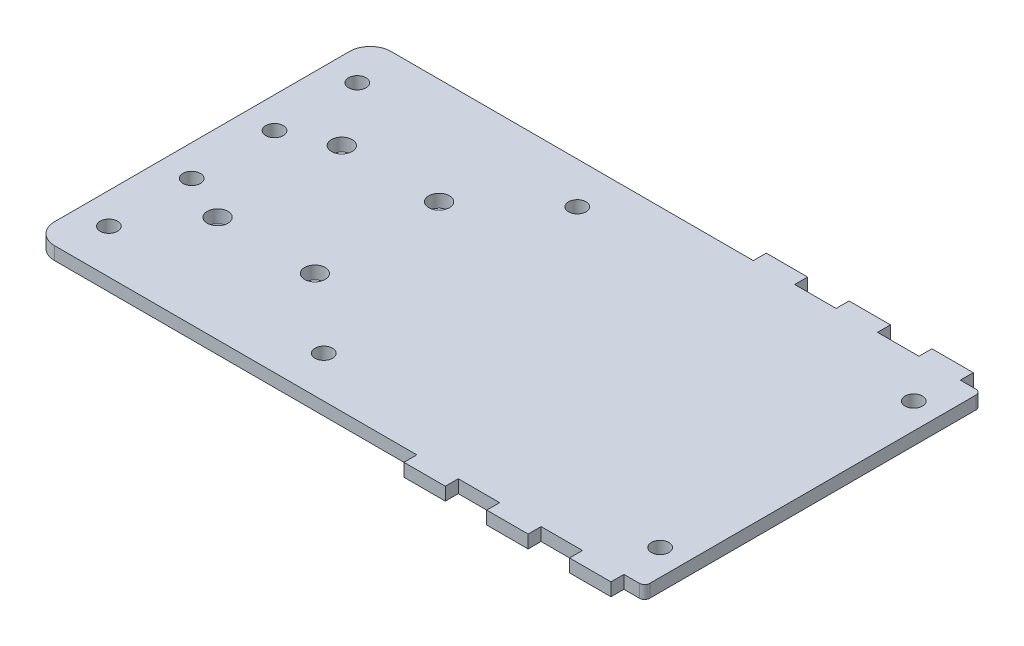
ISO-10303-21;
HEADER;
FILE_DESCRIPTION(('STEP AP214'),'2;1');
FILE_NAME('part.step','',(''),(''),'','','');
FILE_SCHEMA(('AUTOMOTIVE_DESIGN { 1 0 10303 214 1 1 1 1 }'));
ENDSEC;
DATA;
#1=APPLICATION_CONTEXT('core data for automotive mechanical design processes');
#2=APPLICATION_PROTOCOL_DEFINITION('international standard','automotive_design',2000,#1);
#3=PRODUCT_CONTEXT('',#1,'mechanical');
#4=PRODUCT('Part','Part','',(#3));
#5=PRODUCT_RELATED_PRODUCT_CATEGORY('part','',(#4));
#6=PRODUCT_DEFINITION_FORMATION('','',#4);
#7=PRODUCT_DEFINITION_CONTEXT('part definition',#1,'design');
#8=PRODUCT_DEFINITION('design','',#6,#7);
#9=PRODUCT_DEFINITION_SHAPE('','',#8);
#10=(LENGTH_UNIT() NAMED_UNIT(*) SI_UNIT(.MILLI.,.METRE.));
#11=(NAMED_UNIT(*) PLANE_ANGLE_UNIT() SI_UNIT($,.RADIAN.));
#12=(NAMED_UNIT(*) SI_UNIT($,.STERADIAN.) SOLID_ANGLE_UNIT());
#13=UNCERTAINTY_MEASURE_WITH_UNIT(LENGTH_MEASURE(1.E-05),#10,'distance_accuracy_value','');
#14=(GEOMETRIC_REPRESENTATION_CONTEXT(3) GLOBAL_UNCERTAINTY_ASSIGNED_CONTEXT((#13)) GLOBAL_UNIT_ASSIGNED_CONTEXT((#10,
#11,#12)) REPRESENTATION_CONTEXT('',''));
#15=CARTESIAN_POINT('',(0.,0.,0.));
#16=DIRECTION('',(0.,0.,1.));
#17=DIRECTION('',(1.,0.,0.));
#18=AXIS2_PLACEMENT_3D('',#15,#16,#17);
#19=CARTESIAN_POINT('',(0.,3.175,41.275));
#20=DIRECTION('',(0.,0.,1.));
#21=DIRECTION('',(1.,0.,0.));
#22=AXIS2_PLACEMENT_3D('',#19,#20,#21);
#23=PLANE('',#22);
#24=DIRECTION('',(-1.,0.,0.));
#25=VECTOR('',#24,1.);
#26=CARTESIAN_POINT('',(0.,0.,41.275));
#27=LINE('',#26,#25);
#28=CARTESIAN_POINT('',(38.1,0.,41.275));
#29=VERTEX_POINT('',#28);
#30=CARTESIAN_POINT('',(27.94,0.,41.275));
#31=VERTEX_POINT('',#30);
#32=EDGE_CURVE('E493',#29,#31,#27,.T.);
#33=ORIENTED_EDGE('',*,*,#32,.F.);
#34=DIRECTION('',(0.,-1.,0.));
#35=VECTOR('',#34,1.);
#36=CARTESIAN_POINT('',(38.1,3.175,41.275));
#37=LINE('',#36,#35);
#38=CARTESIAN_POINT('',(38.1,3.175,41.275));
#39=VERTEX_POINT('',#38);
#40=EDGE_CURVE('E437',#39,#29,#37,.T.);
#41=ORIENTED_EDGE('',*,*,#40,.F.);
#42=DIRECTION('',(-1.,0.,0.));
#43=VECTOR('',#42,1.);
#44=CARTESIAN_POINT('',(0.,3.175,41.275));
#45=LINE('',#44,#43);
#46=CARTESIAN_POINT('',(27.94,3.175,41.275));
#47=VERTEX_POINT('',#46);
#48=EDGE_CURVE('E442',#39,#47,#45,.T.);
#49=ORIENTED_EDGE('',*,*,#48,.T.);
#50=DIRECTION('',(0.,-1.,0.));
#51=VECTOR('',#50,1.);
#52=CARTESIAN_POINT('',(27.94,3.175,41.275));
#53=LINE('',#52,#51);
#54=EDGE_CURVE('E426',#47,#31,#53,.T.);
#55=ORIENTED_EDGE('',*,*,#54,.T.);
#56=EDGE_LOOP('',(#33,#41,#49,#55));
#57=FACE_BOUND('',#56,.T.);
#58=ADVANCED_FACE('F219',(#57),#23,.T.);
#59=CARTESIAN_POINT('',(38.1,3.175,0.));
#60=DIRECTION('',(1.,0.,0.));
#61=DIRECTION('',(0.,0.,-1.));
#62=AXIS2_PLACEMENT_3D('',#59,#60,#61);
#63=PLANE('',#62);
#64=DIRECTION('',(0.,0.,1.));
#65=VECTOR('',#64,1.);
#66=CARTESIAN_POINT('',(38.1,0.,0.));
#67=LINE('',#66,#65);
#68=CARTESIAN_POINT('',(38.1,0.,44.45));
#69=VERTEX_POINT('',#68);
#70=EDGE_CURVE('E496',#29,#69,#67,.T.);
#71=ORIENTED_EDGE('',*,*,#70,.T.);
#72=DIRECTION('',(0.,-1.,0.));
#73=VECTOR('',#72,1.);
#74=CARTESIAN_POINT('',(38.1,3.175,44.45));
#75=LINE('',#74,#73);
#76=CARTESIAN_POINT('',(38.1,3.175,44.45));
#77=VERTEX_POINT('',#76);
#78=EDGE_CURVE('E547',#77,#69,#75,.T.);
#79=ORIENTED_EDGE('',*,*,#78,.F.);
#80=DIRECTION('',(0.,0.,1.));
#81=VECTOR('',#80,1.);
#82=CARTESIAN_POINT('',(38.1,3.175,0.));
#83=LINE('',#82,#81);
#84=EDGE_CURVE('E449',#39,#77,#83,.T.);
#85=ORIENTED_EDGE('',*,*,#84,.F.);
#86=ORIENTED_EDGE('',*,*,#40,.T.);
#87=EDGE_LOOP('',(#71,#79,#85,#86));
#88=FACE_BOUND('',#87,.T.);
#89=ADVANCED_FACE('F840',(#88),#63,.F.);
#90=CARTESIAN_POINT('',(0.,3.175,44.45));
#91=DIRECTION('',(0.,0.,-1.));
#92=DIRECTION('',(-1.,0.,0.));
#93=AXIS2_PLACEMENT_3D('',#90,#91,#92);
#94=PLANE('',#93);
#95=DIRECTION('',(1.,0.,0.));
#96=VECTOR('',#95,1.);
#97=CARTESIAN_POINT('',(0.,0.,44.45));
#98=LINE('',#97,#96);
#99=CARTESIAN_POINT('',(48.26,0.,44.45));
#100=VERTEX_POINT('',#99);
#101=EDGE_CURVE('E500',#69,#100,#98,.T.);
#102=ORIENTED_EDGE('',*,*,#101,.T.);
#103=DIRECTION('',(0.,-1.,0.));
#104=VECTOR('',#103,1.);
#105=CARTESIAN_POINT('',(48.26,3.175,44.45));
#106=LINE('',#105,#104);
#107=CARTESIAN_POINT('',(48.26,3.175,44.45));
#108=VERTEX_POINT('',#107);
#109=EDGE_CURVE('E545',#108,#100,#106,.T.);
#110=ORIENTED_EDGE('',*,*,#109,.F.);
#111=DIRECTION('',(1.,0.,0.));
#112=VECTOR('',#111,1.);
#113=CARTESIAN_POINT('',(0.,3.175,44.45));
#114=LINE('',#113,#112);
#115=EDGE_CURVE('E453',#77,#108,#114,.T.);
#116=ORIENTED_EDGE('',*,*,#115,.F.);
#117=ORIENTED_EDGE('',*,*,#78,.T.);
#118=EDGE_LOOP('',(#102,#110,#116,#117));
#119=FACE_BOUND('',#118,.T.);
#120=ADVANCED_FACE('F837',(#119),#94,.F.);
#121=CARTESIAN_POINT('',(48.26,3.175,0.));
#122=DIRECTION('',(1.,0.,0.));
#123=DIRECTION('',(0.,0.,-1.));
#124=AXIS2_PLACEMENT_3D('',#121,#122,#123);
#125=PLANE('',#124);
#126=DIRECTION('',(0.,0.,1.));
#127=VECTOR('',#126,1.);
#128=CARTESIAN_POINT('',(48.26,0.,0.));
#129=LINE('',#128,#127);
#130=CARTESIAN_POINT('',(48.26,0.,41.275));
#131=VERTEX_POINT('',#130);
#132=EDGE_CURVE('E503',#131,#100,#129,.T.);
#133=ORIENTED_EDGE('',*,*,#132,.F.);
#134=DIRECTION('',(0.,-1.,0.));
#135=VECTOR('',#134,1.);
#136=CARTESIAN_POINT('',(48.26,3.175,41.275));
#137=LINE('',#136,#135);
#138=CARTESIAN_POINT('',(48.26,3.175,41.275));
#139=VERTEX_POINT('',#138);
#140=EDGE_CURVE('E543',#139,#131,#137,.T.);
#141=ORIENTED_EDGE('',*,*,#140,.F.);
#142=DIRECTION('',(0.,0.,1.));
#143=VECTOR('',#142,1.);
#144=CARTESIAN_POINT('',(48.26,3.175,0.));
#145=LINE('',#144,#143);
#146=EDGE_CURVE('E468',#139,#108,#145,.T.);
#147=ORIENTED_EDGE('',*,*,#146,.T.);
#148=ORIENTED_EDGE('',*,*,#109,.T.);
#149=EDGE_LOOP('',(#133,#141,#147,#148));
#150=FACE_BOUND('',#149,.T.);
#151=ADVANCED_FACE('F833',(#150),#125,.T.);
#152=CARTESIAN_POINT('',(58.42,0.,41.275));
#153=VERTEX_POINT('',#152);
#154=EDGE_CURVE('E506',#153,#131,#27,.T.);
#155=ORIENTED_EDGE('',*,*,#154,.F.);
#156=DIRECTION('',(0.,1.,0.));
#157=VECTOR('',#156,1.);
#158=CARTESIAN_POINT('',(58.42,3.175,41.275));
#159=LINE('',#158,#157);
#160=CARTESIAN_POINT('',(58.42,3.175,41.275));
#161=VERTEX_POINT('',#160);
#162=EDGE_CURVE('E560',#153,#161,#159,.T.);
#163=ORIENTED_EDGE('',*,*,#162,.T.);
#164=EDGE_CURVE('E456',#161,#139,#45,.T.);
#165=ORIENTED_EDGE('',*,*,#164,.T.);
#166=ORIENTED_EDGE('',*,*,#140,.T.);
#167=EDGE_LOOP('',(#155,#163,#165,#166));
#168=FACE_BOUND('',#167,.T.);
#169=ADVANCED_FACE('F836',(#168),#23,.T.);
#170=CARTESIAN_POINT('',(72.39,0.,41.275));
#171=VERTEX_POINT('',#170);
#172=CARTESIAN_POINT('',(68.58,0.,41.275));
#173=VERTEX_POINT('',#172);
#174=EDGE_CURVE('E497',#171,#173,#27,.T.);
#175=ORIENTED_EDGE('',*,*,#174,.F.);
#176=DIRECTION('',(0.,1.,0.));
#177=VECTOR('',#176,1.);
#178=CARTESIAN_POINT('',(72.39,3.175,41.275));
#179=LINE('',#178,#177);
#180=CARTESIAN_POINT('',(72.39,3.175,41.275));
#181=VERTEX_POINT('',#180);
#182=EDGE_CURVE('E645',#171,#181,#179,.T.);
#183=ORIENTED_EDGE('',*,*,#182,.T.);
#184=CARTESIAN_POINT('',(68.58,3.175,41.275));
#185=VERTEX_POINT('',#184);
#186=EDGE_CURVE('E451',#181,#185,#45,.T.);
#187=ORIENTED_EDGE('',*,*,#186,.T.);
#188=DIRECTION('',(0.,1.,0.));
#189=VECTOR('',#188,1.);
#190=CARTESIAN_POINT('',(68.58,3.175,41.275));
#191=LINE('',#190,#189);
#192=EDGE_CURVE('E557',#173,#185,#191,.T.);
#193=ORIENTED_EDGE('',*,*,#192,.F.);
#194=EDGE_LOOP('',(#175,#183,#187,#193));
#195=FACE_BOUND('',#194,.T.);
#196=ADVANCED_FACE('F761',(#195),#23,.T.);
#197=CARTESIAN_POINT('',(0.,3.175,-41.275));
#198=DIRECTION('',(0.,0.,1.));
#199=DIRECTION('',(1.,0.,0.));
#200=AXIS2_PLACEMENT_3D('',#197,#198,#199);
#201=PLANE('',#200);
#202=DIRECTION('',(-1.,0.,0.));
#203=VECTOR('',#202,1.);
#204=CARTESIAN_POINT('',(0.,3.175,-41.275));
#205=LINE('',#204,#203);
#206=CARTESIAN_POINT('',(72.39,3.175,-41.275));
#207=VERTEX_POINT('',#206);
#208=CARTESIAN_POINT('',(68.5799999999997,3.175,-41.275));
#209=VERTEX_POINT('',#208);
#210=EDGE_CURVE('E479',#207,#209,#205,.T.);
#211=ORIENTED_EDGE('',*,*,#210,.F.);
#212=DIRECTION('',(0.,1.,0.));
#213=VECTOR('',#212,1.);
#214=CARTESIAN_POINT('',(72.39,3.175,-41.275));
#215=LINE('',#214,#213);
#216=CARTESIAN_POINT('',(72.39,0.,-41.275));
#217=VERTEX_POINT('',#216);
#218=EDGE_CURVE('E227',#207,#217,#215,.F.);
#219=ORIENTED_EDGE('',*,*,#218,.T.);
#220=DIRECTION('',(-1.,0.,0.));
#221=VECTOR('',#220,1.);
#222=CARTESIAN_POINT('',(0.,0.,-41.275));
#223=LINE('',#222,#221);
#224=CARTESIAN_POINT('',(68.5799999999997,0.,-41.275));
#225=VERTEX_POINT('',#224);
#226=EDGE_CURVE('E507',#217,#225,#223,.T.);
#227=ORIENTED_EDGE('',*,*,#226,.T.);
#228=DIRECTION('',(0.,1.,0.));
#229=VECTOR('',#228,1.);
#230=CARTESIAN_POINT('',(68.5799999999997,3.175,-41.275));
#231=LINE('',#230,#229);
#232=EDGE_CURVE('E553',#225,#209,#231,.T.);
#233=ORIENTED_EDGE('',*,*,#232,.T.);
#234=EDGE_LOOP('',(#211,#219,#227,#233));
#235=FACE_BOUND('',#234,.T.);
#236=ADVANCED_FACE('F827',(#235),#201,.F.);
#237=CARTESIAN_POINT('',(58.4199999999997,3.175,-41.275));
#238=VERTEX_POINT('',#237);
#239=CARTESIAN_POINT('',(48.2599999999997,3.175,-41.275));
#240=VERTEX_POINT('',#239);
#241=EDGE_CURVE('E482',#238,#240,#205,.T.);
#242=ORIENTED_EDGE('',*,*,#241,.F.);
#243=DIRECTION('',(0.,-1.,0.));
#244=VECTOR('',#243,1.);
#245=CARTESIAN_POINT('',(58.4199999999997,3.175,-41.2750000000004));
#246=LINE('',#245,#244);
#247=CARTESIAN_POINT('',(58.4199999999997,0.,-41.275));
#248=VERTEX_POINT('',#247);
#249=EDGE_CURVE('E556',#238,#248,#246,.T.);
#250=ORIENTED_EDGE('',*,*,#249,.T.);
#251=CARTESIAN_POINT('',(48.2599999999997,0.,-41.275));
#252=VERTEX_POINT('',#251);
#253=EDGE_CURVE('E510',#248,#252,#223,.T.);
#254=ORIENTED_EDGE('',*,*,#253,.T.);
#255=DIRECTION('',(0.,1.,0.));
#256=VECTOR('',#255,1.);
#257=CARTESIAN_POINT('',(48.2599999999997,3.175,-41.275));
#258=LINE('',#257,#256);
#259=EDGE_CURVE('E436',#252,#240,#258,.T.);
#260=ORIENTED_EDGE('',*,*,#259,.T.);
#261=EDGE_LOOP('',(#242,#250,#254,#260));
#262=FACE_BOUND('',#261,.T.);
#263=ADVANCED_FACE('F792',(#262),#201,.F.);
#264=CARTESIAN_POINT('',(38.0999999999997,3.175,-41.275));
#265=VERTEX_POINT('',#264);
#266=CARTESIAN_POINT('',(27.9399999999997,3.175,-41.275));
#267=VERTEX_POINT('',#266);
#268=EDGE_CURVE('E455',#265,#267,#205,.T.);
#269=ORIENTED_EDGE('',*,*,#268,.F.);
#270=DIRECTION('',(0.,-1.,0.));
#271=VECTOR('',#270,1.);
#272=CARTESIAN_POINT('',(38.0999999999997,3.175,-41.275));
#273=LINE('',#272,#271);
#274=CARTESIAN_POINT('',(38.0999999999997,0.,-41.275));
#275=VERTEX_POINT('',#274);
#276=EDGE_CURVE('E552',#265,#275,#273,.T.);
#277=ORIENTED_EDGE('',*,*,#276,.T.);
#278=CARTESIAN_POINT('',(27.9399999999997,0.,-41.275));
#279=VERTEX_POINT('',#278);
#280=EDGE_CURVE('E511',#275,#279,#223,.T.);
#281=ORIENTED_EDGE('',*,*,#280,.T.);
#282=DIRECTION('',(0.,-1.,0.));
#283=VECTOR('',#282,1.);
#284=CARTESIAN_POINT('',(27.9399999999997,3.175,-41.275));
#285=LINE('',#284,#283);
#286=EDGE_CURVE('E540',#267,#279,#285,.T.);
#287=ORIENTED_EDGE('',*,*,#286,.F.);
#288=EDGE_LOOP('',(#269,#277,#281,#287));
#289=FACE_BOUND('',#288,.T.);
#290=ADVANCED_FACE('F809',(#289),#201,.F.);
#291=CARTESIAN_POINT('',(27.9399999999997,3.175,0.));
#292=DIRECTION('',(1.,0.,0.));
#293=DIRECTION('',(0.,0.,-1.));
#294=AXIS2_PLACEMENT_3D('',#291,#292,#293);
#295=PLANE('',#294);
#296=DIRECTION('',(0.,0.,1.));
#297=VECTOR('',#296,1.);
#298=CARTESIAN_POINT('',(27.9399999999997,0.,0.));
#299=LINE('',#298,#297);
#300=CARTESIAN_POINT('',(27.9399999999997,0.,-44.4499999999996));
#301=VERTEX_POINT('',#300);
#302=EDGE_CURVE('E509',#301,#279,#299,.T.);
#303=ORIENTED_EDGE('',*,*,#302,.F.);
#304=DIRECTION('',(0.,-1.,0.));
#305=VECTOR('',#304,1.);
#306=CARTESIAN_POINT('',(27.9399999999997,3.175,-44.4499999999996));
#307=LINE('',#306,#305);
#308=CARTESIAN_POINT('',(27.9399999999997,3.175,-44.4499999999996));
#309=VERTEX_POINT('',#308);
#310=EDGE_CURVE('E538',#309,#301,#307,.T.);
#311=ORIENTED_EDGE('',*,*,#310,.F.);
#312=DIRECTION('',(0.,0.,1.));
#313=VECTOR('',#312,1.);
#314=CARTESIAN_POINT('',(27.9399999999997,3.175,0.));
#315=LINE('',#314,#313);
#316=EDGE_CURVE('E481',#309,#267,#315,.T.);
#317=ORIENTED_EDGE('',*,*,#316,.T.);
#318=ORIENTED_EDGE('',*,*,#286,.T.);
#319=EDGE_LOOP('',(#303,#311,#317,#318));
#320=FACE_BOUND('',#319,.T.);
#321=ADVANCED_FACE('F813',(#320),#295,.T.);
#322=CARTESIAN_POINT('',(0.,3.175,-44.4499999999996));
#323=DIRECTION('',(0.,0.,-1.));
#324=DIRECTION('',(-1.,0.,0.));
#325=AXIS2_PLACEMENT_3D('',#322,#323,#324);
#326=PLANE('',#325);
#327=DIRECTION('',(1.,0.,0.));
#328=VECTOR('',#327,1.);
#329=CARTESIAN_POINT('',(0.,0.,-44.4499999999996));
#330=LINE('',#329,#328);
#331=CARTESIAN_POINT('',(17.7799999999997,0.,-44.4499999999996));
#332=VERTEX_POINT('',#331);
#333=EDGE_CURVE('E515',#332,#301,#330,.T.);
#334=ORIENTED_EDGE('',*,*,#333,.F.);
#335=DIRECTION('',(0.,-1.,0.));
#336=VECTOR('',#335,1.);
#337=CARTESIAN_POINT('',(17.7799999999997,3.175,-44.4499999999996));
#338=LINE('',#337,#336);
#339=CARTESIAN_POINT('',(17.7799999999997,3.175,-44.4499999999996));
#340=VERTEX_POINT('',#339);
#341=EDGE_CURVE('E536',#340,#332,#338,.T.);
#342=ORIENTED_EDGE('',*,*,#341,.F.);
#343=DIRECTION('',(1.,0.,0.));
#344=VECTOR('',#343,1.);
#345=CARTESIAN_POINT('',(0.,3.175,-44.4499999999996));
#346=LINE('',#345,#344);
#347=EDGE_CURVE('E485',#340,#309,#346,.T.);
#348=ORIENTED_EDGE('',*,*,#347,.T.);
#349=ORIENTED_EDGE('',*,*,#310,.T.);
#350=EDGE_LOOP('',(#334,#342,#348,#349));
#351=FACE_BOUND('',#350,.T.);
#352=ADVANCED_FACE('F816',(#351),#326,.T.);
#353=CARTESIAN_POINT('',(17.7799999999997,3.175,0.));
#354=DIRECTION('',(1.,0.,0.));
#355=DIRECTION('',(0.,0.,-1.));
#356=AXIS2_PLACEMENT_3D('',#353,#354,#355);
#357=PLANE('',#356);
#358=DIRECTION('',(0.,0.,1.));
#359=VECTOR('',#358,1.);
#360=CARTESIAN_POINT('',(17.7799999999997,0.,0.));
#361=LINE('',#360,#359);
#362=CARTESIAN_POINT('',(17.7799999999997,0.,-41.275));
#363=VERTEX_POINT('',#362);
#364=EDGE_CURVE('E518',#332,#363,#361,.T.);
#365=ORIENTED_EDGE('',*,*,#364,.T.);
#366=DIRECTION('',(0.,-1.,0.));
#367=VECTOR('',#366,1.);
#368=CARTESIAN_POINT('',(17.7799999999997,3.175,-41.275));
#369=LINE('',#368,#367);
#370=CARTESIAN_POINT('',(17.7799999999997,3.175,-41.275));
#371=VERTEX_POINT('',#370);
#372=EDGE_CURVE('E533',#371,#363,#369,.T.);
#373=ORIENTED_EDGE('',*,*,#372,.F.);
#374=DIRECTION('',(0.,0.,1.));
#375=VECTOR('',#374,1.);
#376=CARTESIAN_POINT('',(17.7799999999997,3.175,0.));
#377=LINE('',#376,#375);
#378=EDGE_CURVE('E488',#340,#371,#377,.T.);
#379=ORIENTED_EDGE('',*,*,#378,.F.);
#380=ORIENTED_EDGE('',*,*,#341,.T.);
#381=EDGE_LOOP('',(#365,#373,#379,#380));
#382=FACE_BOUND('',#381,.T.);
#383=ADVANCED_FACE('F819',(#382),#357,.F.);
#384=CARTESIAN_POINT('',(-71.12,0.,-41.275));
#385=VERTEX_POINT('',#384);
#386=EDGE_CURVE('E512',#363,#385,#223,.T.);
#387=ORIENTED_EDGE('',*,*,#386,.T.);
#388=DIRECTION('',(0.,-1.,0.));
#389=VECTOR('',#388,1.);
#390=CARTESIAN_POINT('',(-71.12,3.175,-41.275));
#391=LINE('',#390,#389);
#392=CARTESIAN_POINT('',(-71.12,3.175,-41.275));
#393=VERTEX_POINT('',#392);
#394=EDGE_CURVE('E643',#385,#393,#391,.F.);
#395=ORIENTED_EDGE('',*,*,#394,.T.);
#396=EDGE_CURVE('E466',#371,#393,#205,.T.);
#397=ORIENTED_EDGE('',*,*,#396,.F.);
#398=ORIENTED_EDGE('',*,*,#372,.T.);
#399=EDGE_LOOP('',(#387,#395,#397,#398));
#400=FACE_BOUND('',#399,.T.);
#401=ADVANCED_FACE('F786',(#400),#201,.F.);
#402=CARTESIAN_POINT('',(-76.2,3.175,0.));
#403=DIRECTION('',(-1.,0.,0.));
#404=DIRECTION('',(0.,0.,1.));
#405=AXIS2_PLACEMENT_3D('',#402,#403,#404);
#406=PLANE('',#405);
#407=DIRECTION('',(0.,0.,-1.));
#408=VECTOR('',#407,1.);
#409=CARTESIAN_POINT('',(-76.2,0.,0.));
#410=LINE('',#409,#408);
#411=CARTESIAN_POINT('',(-76.2,0.,36.195));
#412=VERTEX_POINT('',#411);
#413=CARTESIAN_POINT('',(-76.2,0.,-36.195));
#414=VERTEX_POINT('',#413);
#415=EDGE_CURVE('E520',#412,#414,#410,.T.);
#416=ORIENTED_EDGE('',*,*,#415,.F.);
#417=DIRECTION('',(0.,-1.,0.));
#418=VECTOR('',#417,1.);
#419=CARTESIAN_POINT('',(-76.2,3.175,36.195));
#420=LINE('',#419,#418);
#421=CARTESIAN_POINT('',(-76.2,3.175,36.195));
#422=VERTEX_POINT('',#421);
#423=EDGE_CURVE('E637',#412,#422,#420,.F.);
#424=ORIENTED_EDGE('',*,*,#423,.T.);
#425=DIRECTION('',(0.,0.,-1.));
#426=VECTOR('',#425,1.);
#427=CARTESIAN_POINT('',(-76.2,3.175,0.));
#428=LINE('',#427,#426);
#429=CARTESIAN_POINT('',(-76.2,3.175,-36.195));
#430=VERTEX_POINT('',#429);
#431=EDGE_CURVE('E459',#422,#430,#428,.T.);
#432=ORIENTED_EDGE('',*,*,#431,.T.);
#433=DIRECTION('',(0.,-1.,0.));
#434=VECTOR('',#433,1.);
#435=CARTESIAN_POINT('',(-76.2,0.,-36.195));
#436=LINE('',#435,#434);
#437=EDGE_CURVE('E634',#430,#414,#436,.T.);
#438=ORIENTED_EDGE('',*,*,#437,.T.);
#439=EDGE_LOOP('',(#416,#424,#432,#438));
#440=FACE_BOUND('',#439,.T.);
#441=ADVANCED_FACE('F776',(#440),#406,.T.);
#442=CARTESIAN_POINT('',(17.78,3.175,41.275));
#443=VERTEX_POINT('',#442);
#444=CARTESIAN_POINT('',(-71.12,3.175,41.275));
#445=VERTEX_POINT('',#444);
#446=EDGE_CURVE('E452',#443,#445,#45,.T.);
#447=ORIENTED_EDGE('',*,*,#446,.T.);
#448=DIRECTION('',(0.,-1.,0.));
#449=VECTOR('',#448,1.);
#450=CARTESIAN_POINT('',(-71.12,3.175,41.275));
#451=LINE('',#450,#449);
#452=CARTESIAN_POINT('',(-71.12,0.,41.275));
#453=VERTEX_POINT('',#452);
#454=EDGE_CURVE('E562',#445,#453,#451,.T.);
#455=ORIENTED_EDGE('',*,*,#454,.T.);
#456=CARTESIAN_POINT('',(17.78,0.,41.275));
#457=VERTEX_POINT('',#456);
#458=EDGE_CURVE('E498',#457,#453,#27,.T.);
#459=ORIENTED_EDGE('',*,*,#458,.F.);
#460=DIRECTION('',(0.,-1.,0.));
#461=VECTOR('',#460,1.);
#462=CARTESIAN_POINT('',(17.78,3.175,41.275));
#463=LINE('',#462,#461);
#464=EDGE_CURVE('E531',#443,#457,#463,.T.);
#465=ORIENTED_EDGE('',*,*,#464,.F.);
#466=EDGE_LOOP('',(#447,#455,#459,#465));
#467=FACE_BOUND('',#466,.T.);
#468=ADVANCED_FACE('F770',(#467),#23,.T.);
#469=CARTESIAN_POINT('',(17.78,3.175,0.));
#470=DIRECTION('',(1.,0.,0.));
#471=DIRECTION('',(0.,0.,-1.));
#472=AXIS2_PLACEMENT_3D('',#469,#470,#471);
#473=PLANE('',#472);
#474=DIRECTION('',(0.,0.,1.));
#475=VECTOR('',#474,1.);
#476=CARTESIAN_POINT('',(17.78,0.,0.));
#477=LINE('',#476,#475);
#478=CARTESIAN_POINT('',(17.78,0.,44.4500000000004));
#479=VERTEX_POINT('',#478);
#480=EDGE_CURVE('E523',#457,#479,#477,.T.);
#481=ORIENTED_EDGE('',*,*,#480,.T.);
#482=DIRECTION('',(0.,-1.,0.));
#483=VECTOR('',#482,1.);
#484=CARTESIAN_POINT('',(17.78,3.175,44.4500000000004));
#485=LINE('',#484,#483);
#486=CARTESIAN_POINT('',(17.78,3.175,44.4500000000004));
#487=VERTEX_POINT('',#486);
#488=EDGE_CURVE('E528',#487,#479,#485,.T.);
#489=ORIENTED_EDGE('',*,*,#488,.F.);
#490=DIRECTION('',(0.,0.,1.));
#491=VECTOR('',#490,1.);
#492=CARTESIAN_POINT('',(17.78,3.175,0.));
#493=LINE('',#492,#491);
#494=EDGE_CURVE('E458',#443,#487,#493,.T.);
#495=ORIENTED_EDGE('',*,*,#494,.F.);
#496=ORIENTED_EDGE('',*,*,#464,.T.);
#497=EDGE_LOOP('',(#481,#489,#495,#496));
#498=FACE_BOUND('',#497,.T.);
#499=ADVANCED_FACE('F895',(#498),#473,.F.);
#500=CARTESIAN_POINT('',(0.,3.175,44.4500000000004));
#501=DIRECTION('',(0.,0.,-1.));
#502=DIRECTION('',(-1.,0.,0.));
#503=AXIS2_PLACEMENT_3D('',#500,#501,#502);
#504=PLANE('',#503);
#505=DIRECTION('',(1.,0.,0.));
#506=VECTOR('',#505,1.);
#507=CARTESIAN_POINT('',(0.,0.,44.4500000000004));
#508=LINE('',#507,#506);
#509=CARTESIAN_POINT('',(27.94,0.,44.4500000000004));
#510=VERTEX_POINT('',#509);
#511=EDGE_CURVE('E446',#479,#510,#508,.T.);
#512=ORIENTED_EDGE('',*,*,#511,.T.);
#513=DIRECTION('',(0.,-1.,0.));
#514=VECTOR('',#513,1.);
#515=CARTESIAN_POINT('',(27.94,3.175,44.4500000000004));
#516=LINE('',#515,#514);
#517=CARTESIAN_POINT('',(27.94,3.175,44.4500000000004));
#518=VERTEX_POINT('',#517);
#519=EDGE_CURVE('E491',#518,#510,#516,.T.);
#520=ORIENTED_EDGE('',*,*,#519,.F.);
#521=DIRECTION('',(1.,0.,0.));
#522=VECTOR('',#521,1.);
#523=CARTESIAN_POINT('',(0.,3.175,44.4500000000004));
#524=LINE('',#523,#522);
#525=EDGE_CURVE('E444',#487,#518,#524,.T.);
#526=ORIENTED_EDGE('',*,*,#525,.F.);
#527=ORIENTED_EDGE('',*,*,#488,.T.);
#528=EDGE_LOOP('',(#512,#520,#526,#527));
#529=FACE_BOUND('',#528,.T.);
#530=ADVANCED_FACE('F847',(#529),#504,.F.);
#531=CARTESIAN_POINT('',(27.94,3.175,0.));
#532=DIRECTION('',(1.,0.,0.));
#533=DIRECTION('',(0.,0.,-1.));
#534=AXIS2_PLACEMENT_3D('',#531,#532,#533);
#535=PLANE('',#534);
#536=DIRECTION('',(0.,0.,1.));
#537=VECTOR('',#536,1.);
#538=CARTESIAN_POINT('',(27.94,0.,0.));
#539=LINE('',#538,#537);
#540=EDGE_CURVE('E431',#31,#510,#539,.T.);
#541=ORIENTED_EDGE('',*,*,#540,.F.);
#542=ORIENTED_EDGE('',*,*,#54,.F.);
#543=DIRECTION('',(0.,0.,1.));
#544=VECTOR('',#543,1.);
#545=CARTESIAN_POINT('',(27.94,3.175,0.));
#546=LINE('',#545,#544);
#547=EDGE_CURVE('E429',#47,#518,#546,.T.);
#548=ORIENTED_EDGE('',*,*,#547,.T.);
#549=ORIENTED_EDGE('',*,*,#519,.T.);
#550=EDGE_LOOP('',(#541,#542,#548,#549));
#551=FACE_BOUND('',#550,.T.);
#552=ADVANCED_FACE('F428',(#551),#535,.T.);
#553=CARTESIAN_POINT('',(0.,0.,0.));
#554=DIRECTION('',(0.,1.,0.));
#555=DIRECTION('',(0.,0.,1.));
#556=AXIS2_PLACEMENT_3D('',#553,#554,#555);
#557=PLANE('',#556);
#558=CARTESIAN_POINT('',(-68.58,0.,30.48));
#559=DIRECTION('',(0.,1.,0.));
#560=DIRECTION('',(0.,0.,1.));
#561=AXIS2_PLACEMENT_3D('',#558,#559,#560);
#562=CIRCLE('',#561,2.15);
#563=CARTESIAN_POINT('',(-68.58,0.,32.63));
#564=VERTEX_POINT('',#563);
#565=EDGE_CURVE('E1170',#564,#564,#562,.T.);
#566=ORIENTED_EDGE('',*,*,#565,.T.);
#567=EDGE_LOOP('',(#566));
#568=FACE_BOUND('',#567,.T.);
#569=CARTESIAN_POINT('',(-68.5800000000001,0.,10.16));
#570=DIRECTION('',(0.,1.,0.));
#571=DIRECTION('',(0.,0.,1.));
#572=AXIS2_PLACEMENT_3D('',#569,#570,#571);
#573=CIRCLE('',#572,2.15);
#574=CARTESIAN_POINT('',(-68.5800000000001,0.,12.31));
#575=VERTEX_POINT('',#574);
#576=EDGE_CURVE('E1173',#575,#575,#573,.T.);
#577=ORIENTED_EDGE('',*,*,#576,.T.);
#578=EDGE_LOOP('',(#577));
#579=FACE_BOUND('',#578,.T.);
#580=CARTESIAN_POINT('',(-68.5800000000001,0.,-10.16));
#581=DIRECTION('',(0.,1.,0.));
#582=DIRECTION('',(0.,0.,1.));
#583=AXIS2_PLACEMENT_3D('',#580,#581,#582);
#584=CIRCLE('',#583,2.15);
#585=CARTESIAN_POINT('',(-68.5800000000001,0.,-8.00999999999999));
#586=VERTEX_POINT('',#585);
#587=EDGE_CURVE('E1183',#586,#586,#584,.T.);
#588=ORIENTED_EDGE('',*,*,#587,.T.);
#589=EDGE_LOOP('',(#588));
#590=FACE_BOUND('',#589,.T.);
#591=CARTESIAN_POINT('',(-68.5800000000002,0.,-30.48));
#592=DIRECTION('',(0.,1.,0.));
#593=DIRECTION('',(0.,0.,1.));
#594=AXIS2_PLACEMENT_3D('',#591,#592,#593);
#595=CIRCLE('',#594,2.15);
#596=CARTESIAN_POINT('',(-68.5800000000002,0.,-28.33));
#597=VERTEX_POINT('',#596);
#598=EDGE_CURVE('E1189',#597,#597,#595,.T.);
#599=ORIENTED_EDGE('',*,*,#598,.T.);
#600=EDGE_LOOP('',(#599));
#601=FACE_BOUND('',#600,.T.);
#602=CARTESIAN_POINT('',(-15.24,0.,31.115));
#603=DIRECTION('',(0.,1.,0.));
#604=DIRECTION('',(0.,0.,1.));
#605=AXIS2_PLACEMENT_3D('',#602,#603,#604);
#606=CIRCLE('',#605,2.15);
#607=CARTESIAN_POINT('',(-15.24,0.,33.265));
#608=VERTEX_POINT('',#607);
#609=EDGE_CURVE('E1207',#608,#608,#606,.T.);
#610=ORIENTED_EDGE('',*,*,#609,.T.);
#611=EDGE_LOOP('',(#610));
#612=FACE_BOUND('',#611,.T.);
#613=CARTESIAN_POINT('',(67.31,0.,31.115));
#614=DIRECTION('',(0.,1.,0.));
#615=DIRECTION('',(0.,0.,1.));
#616=AXIS2_PLACEMENT_3D('',#613,#614,#615);
#617=CIRCLE('',#616,2.15);
#618=CARTESIAN_POINT('',(67.31,0.,33.265));
#619=VERTEX_POINT('',#618);
#620=EDGE_CURVE('E1201',#619,#619,#617,.T.);
#621=ORIENTED_EDGE('',*,*,#620,.T.);
#622=EDGE_LOOP('',(#621));
#623=FACE_BOUND('',#622,.T.);
#624=CARTESIAN_POINT('',(67.31,0.,-31.115));
#625=DIRECTION('',(0.,1.,0.));
#626=DIRECTION('',(0.,0.,1.));
#627=AXIS2_PLACEMENT_3D('',#624,#625,#626);
#628=CIRCLE('',#627,2.15);
#629=CARTESIAN_POINT('',(67.31,0.,-28.965));
#630=VERTEX_POINT('',#629);
#631=EDGE_CURVE('E1195',#630,#630,#628,.T.);
#632=ORIENTED_EDGE('',*,*,#631,.T.);
#633=EDGE_LOOP('',(#632));
#634=FACE_BOUND('',#633,.T.);
#635=CARTESIAN_POINT('',(-15.24,0.,-31.115));
#636=DIRECTION('',(0.,1.,0.));
#637=DIRECTION('',(0.,0.,1.));
#638=AXIS2_PLACEMENT_3D('',#635,#636,#637);
#639=CIRCLE('',#638,2.15);
#640=CARTESIAN_POINT('',(-15.24,0.,-28.965));
#641=VERTEX_POINT('',#640);
#642=EDGE_CURVE('E669',#641,#641,#639,.T.);
#643=ORIENTED_EDGE('',*,*,#642,.T.);
#644=EDGE_LOOP('',(#643));
#645=FACE_BOUND('',#644,.T.);
#646=CARTESIAN_POINT('',(-57.15,0.,15.24));
#647=DIRECTION('',(0.,1.,0.));
#648=DIRECTION('',(0.,0.,1.));
#649=AXIS2_PLACEMENT_3D('',#646,#647,#648);
#650=CIRCLE('',#649,2.54);
#651=CARTESIAN_POINT('',(-57.15,0.,17.78));
#652=VERTEX_POINT('',#651);
#653=EDGE_CURVE('E691',#652,#652,#650,.T.);
#654=ORIENTED_EDGE('',*,*,#653,.T.);
#655=EDGE_LOOP('',(#654));
#656=FACE_BOUND('',#655,.T.);
#657=CARTESIAN_POINT('',(-33.274,0.,15.24));
#658=DIRECTION('',(0.,1.,0.));
#659=DIRECTION('',(0.,0.,1.));
#660=AXIS2_PLACEMENT_3D('',#657,#658,#659);
#661=CIRCLE('',#660,2.54);
#662=CARTESIAN_POINT('',(-33.274,0.,17.78));
#663=VERTEX_POINT('',#662);
#664=EDGE_CURVE('E685',#663,#663,#661,.T.);
#665=ORIENTED_EDGE('',*,*,#664,.T.);
#666=EDGE_LOOP('',(#665));
#667=FACE_BOUND('',#666,.T.);
#668=CARTESIAN_POINT('',(-33.274,0.,-15.24));
#669=DIRECTION('',(0.,1.,0.));
#670=DIRECTION('',(0.,0.,1.));
#671=AXIS2_PLACEMENT_3D('',#668,#669,#670);
#672=CIRCLE('',#671,2.54);
#673=CARTESIAN_POINT('',(-33.274,0.,-12.7));
#674=VERTEX_POINT('',#673);
#675=EDGE_CURVE('E678',#674,#674,#672,.T.);
#676=ORIENTED_EDGE('',*,*,#675,.T.);
#677=EDGE_LOOP('',(#676));
#678=FACE_BOUND('',#677,.T.);
#679=CARTESIAN_POINT('',(-57.15,0.,-15.24));
#680=DIRECTION('',(0.,1.,0.));
#681=DIRECTION('',(0.,0.,1.));
#682=AXIS2_PLACEMENT_3D('',#679,#680,#681);
#683=CIRCLE('',#682,2.54);
#684=CARTESIAN_POINT('',(-57.15,0.,-12.7));
#685=VERTEX_POINT('',#684);
#686=EDGE_CURVE('E621',#685,#685,#683,.T.);
#687=ORIENTED_EDGE('',*,*,#686,.T.);
#688=EDGE_LOOP('',(#687));
#689=FACE_BOUND('',#688,.T.);
#690=ORIENTED_EDGE('',*,*,#226,.F.);
#691=CARTESIAN_POINT('',(72.39,0.,-40.005));
#692=DIRECTION('',(0.,1.,0.));
#693=DIRECTION('',(0.,0.,1.));
#694=AXIS2_PLACEMENT_3D('',#691,#692,#693);
#695=CIRCLE('',#694,1.27);
#696=CARTESIAN_POINT('',(73.66,0.,-40.005));
#697=VERTEX_POINT('',#696);
#698=EDGE_CURVE('E12',#217,#697,#695,.F.);
#699=ORIENTED_EDGE('',*,*,#698,.T.);
#700=DIRECTION('',(0.,0.,1.));
#701=VECTOR('',#700,1.);
#702=CARTESIAN_POINT('',(73.66,0.,-41.275));
#703=LINE('',#702,#701);
#704=CARTESIAN_POINT('',(73.66,0.,40.005));
#705=VERTEX_POINT('',#704);
#706=EDGE_CURVE('E664',#697,#705,#703,.T.);
#707=ORIENTED_EDGE('',*,*,#706,.T.);
#708=CARTESIAN_POINT('',(72.39,0.,40.005));
#709=DIRECTION('',(0.,1.,0.));
#710=DIRECTION('',(0.,0.,1.));
#711=AXIS2_PLACEMENT_3D('',#708,#709,#710);
#712=CIRCLE('',#711,1.27);
#713=EDGE_CURVE('E654',#705,#171,#712,.F.);
#714=ORIENTED_EDGE('',*,*,#713,.T.);
#715=ORIENTED_EDGE('',*,*,#174,.T.);
#716=DIRECTION('',(0.,0.,1.));
#717=VECTOR('',#716,1.);
#718=CARTESIAN_POINT('',(68.58,0.,41.2749999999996));
#719=LINE('',#718,#717);
#720=CARTESIAN_POINT('',(68.58,0.,44.4499999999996));
#721=VERTEX_POINT('',#720);
#722=EDGE_CURVE('E572',#173,#721,#719,.T.);
#723=ORIENTED_EDGE('',*,*,#722,.T.);
#724=DIRECTION('',(1.,0.,0.));
#725=VECTOR('',#724,1.);
#726=CARTESIAN_POINT('',(58.42,0.,44.4499999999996));
#727=LINE('',#726,#725);
#728=CARTESIAN_POINT('',(58.42,0.,44.4499999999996));
#729=VERTEX_POINT('',#728);
#730=EDGE_CURVE('E575',#729,#721,#727,.T.);
#731=ORIENTED_EDGE('',*,*,#730,.F.);
#732=DIRECTION('',(0.,0.,1.));
#733=VECTOR('',#732,1.);
#734=CARTESIAN_POINT('',(58.42,0.,41.2749999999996));
#735=LINE('',#734,#733);
#736=EDGE_CURVE('E567',#153,#729,#735,.T.);
#737=ORIENTED_EDGE('',*,*,#736,.F.);
#738=ORIENTED_EDGE('',*,*,#154,.T.);
#739=ORIENTED_EDGE('',*,*,#132,.T.);
#740=ORIENTED_EDGE('',*,*,#101,.F.);
#741=ORIENTED_EDGE('',*,*,#70,.F.);
#742=ORIENTED_EDGE('',*,*,#32,.T.);
#743=ORIENTED_EDGE('',*,*,#540,.T.);
#744=ORIENTED_EDGE('',*,*,#511,.F.);
#745=ORIENTED_EDGE('',*,*,#480,.F.);
#746=ORIENTED_EDGE('',*,*,#458,.T.);
#747=CARTESIAN_POINT('',(-71.12,0.,36.195));
#748=DIRECTION('',(0.,1.,0.));
#749=DIRECTION('',(0.,0.,1.));
#750=AXIS2_PLACEMENT_3D('',#747,#748,#749);
#751=CIRCLE('',#750,5.08);
#752=EDGE_CURVE('E632',#453,#412,#751,.F.);
#753=ORIENTED_EDGE('',*,*,#752,.T.);
#754=ORIENTED_EDGE('',*,*,#415,.T.);
#755=CARTESIAN_POINT('',(-71.12,0.,-36.195));
#756=DIRECTION('',(0.,1.,0.));
#757=DIRECTION('',(0.,0.,1.));
#758=AXIS2_PLACEMENT_3D('',#755,#756,#757);
#759=CIRCLE('',#758,5.08);
#760=EDGE_CURVE('E630',#414,#385,#759,.F.);
#761=ORIENTED_EDGE('',*,*,#760,.T.);
#762=ORIENTED_EDGE('',*,*,#386,.F.);
#763=ORIENTED_EDGE('',*,*,#364,.F.);
#764=ORIENTED_EDGE('',*,*,#333,.T.);
#765=ORIENTED_EDGE('',*,*,#302,.T.);
#766=ORIENTED_EDGE('',*,*,#280,.F.);
#767=DIRECTION('',(0.,0.,1.));
#768=VECTOR('',#767,1.);
#769=CARTESIAN_POINT('',(38.0999999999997,0.,-44.45));
#770=LINE('',#769,#768);
#771=CARTESIAN_POINT('',(38.0999999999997,0.,-44.45));
#772=VERTEX_POINT('',#771);
#773=EDGE_CURVE('E617',#772,#275,#770,.T.);
#774=ORIENTED_EDGE('',*,*,#773,.F.);
#775=DIRECTION('',(1.,0.,0.));
#776=VECTOR('',#775,1.);
#777=CARTESIAN_POINT('',(38.0999999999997,0.,-44.45));
#778=LINE('',#777,#776);
#779=CARTESIAN_POINT('',(48.2599999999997,0.,-44.45));
#780=VERTEX_POINT('',#779);
#781=EDGE_CURVE('E610',#772,#780,#778,.T.);
#782=ORIENTED_EDGE('',*,*,#781,.T.);
#783=DIRECTION('',(0.,0.,1.));
#784=VECTOR('',#783,1.);
#785=CARTESIAN_POINT('',(48.2599999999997,0.,-44.45));
#786=LINE('',#785,#784);
#787=EDGE_CURVE('E620',#780,#252,#786,.T.);
#788=ORIENTED_EDGE('',*,*,#787,.T.);
#789=ORIENTED_EDGE('',*,*,#253,.F.);
#790=DIRECTION('',(0.,0.,1.));
#791=VECTOR('',#790,1.);
#792=CARTESIAN_POINT('',(58.4199999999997,0.,-44.4500000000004));
#793=LINE('',#792,#791);
#794=CARTESIAN_POINT('',(58.4199999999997,0.,-44.4500000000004));
#795=VERTEX_POINT('',#794);
#796=EDGE_CURVE('E594',#795,#248,#793,.T.);
#797=ORIENTED_EDGE('',*,*,#796,.F.);
#798=DIRECTION('',(1.,0.,0.));
#799=VECTOR('',#798,1.);
#800=CARTESIAN_POINT('',(58.4199999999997,0.,-44.4500000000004));
#801=LINE('',#800,#799);
#802=CARTESIAN_POINT('',(68.5799999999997,0.,-44.4500000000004));
#803=VERTEX_POINT('',#802);
#804=EDGE_CURVE('E587',#795,#803,#801,.T.);
#805=ORIENTED_EDGE('',*,*,#804,.T.);
#806=DIRECTION('',(0.,0.,1.));
#807=VECTOR('',#806,1.);
#808=CARTESIAN_POINT('',(68.5799999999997,0.,-44.4500000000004));
#809=LINE('',#808,#807);
#810=EDGE_CURVE('E597',#803,#225,#809,.T.);
#811=ORIENTED_EDGE('',*,*,#810,.T.);
#812=EDGE_LOOP('',(#690,#699,#707,#714,#715,#723,#731,#737,#738,#739,#740,#741,#742,#743,#744,
#745,#746,#753,#754,#761,#762,#763,#764,#765,#766,#774,#782,#788,#789,#797,#805,#811));
#813=FACE_BOUND('',#812,.T.);
#814=ADVANCED_FACE('F705',(#568,#579,#590,#601,#612,#623,#634,#645,#656,#667,#678,#689,#813),
#557,.F.);
#815=CARTESIAN_POINT('',(0.,3.175,0.));
#816=DIRECTION('',(0.,1.,0.));
#817=DIRECTION('',(0.,0.,1.));
#818=AXIS2_PLACEMENT_3D('',#815,#816,#817);
#819=PLANE('',#818);
#820=CARTESIAN_POINT('',(-68.58,3.175,30.48));
#821=DIRECTION('',(0.,1.,0.));
#822=DIRECTION('',(0.,0.,1.));
#823=AXIS2_PLACEMENT_3D('',#820,#821,#822);
#824=CIRCLE('',#823,2.15);
#825=CARTESIAN_POINT('',(-68.58,3.175,32.63));
#826=VERTEX_POINT('',#825);
#827=EDGE_CURVE('E1172',#826,#826,#824,.T.);
#828=ORIENTED_EDGE('',*,*,#827,.F.);
#829=EDGE_LOOP('',(#828));
#830=FACE_BOUND('',#829,.T.);
#831=CARTESIAN_POINT('',(-68.5800000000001,3.175,10.16));
#832=DIRECTION('',(0.,1.,0.));
#833=DIRECTION('',(0.,0.,1.));
#834=AXIS2_PLACEMENT_3D('',#831,#832,#833);
#835=CIRCLE('',#834,2.15);
#836=CARTESIAN_POINT('',(-68.5800000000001,3.175,12.31));
#837=VERTEX_POINT('',#836);
#838=EDGE_CURVE('E1178',#837,#837,#835,.T.);
#839=ORIENTED_EDGE('',*,*,#838,.F.);
#840=EDGE_LOOP('',(#839));
#841=FACE_BOUND('',#840,.T.);
#842=CARTESIAN_POINT('',(-68.5800000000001,3.175,-10.16));
#843=DIRECTION('',(0.,1.,0.));
#844=DIRECTION('',(0.,0.,1.));
#845=AXIS2_PLACEMENT_3D('',#842,#843,#844);
#846=CIRCLE('',#845,2.15);
#847=CARTESIAN_POINT('',(-68.5800000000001,3.175,-8.00999999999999));
#848=VERTEX_POINT('',#847);
#849=EDGE_CURVE('E1186',#848,#848,#846,.T.);
#850=ORIENTED_EDGE('',*,*,#849,.F.);
#851=EDGE_LOOP('',(#850));
#852=FACE_BOUND('',#851,.T.);
#853=CARTESIAN_POINT('',(-68.5800000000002,3.175,-30.48));
#854=DIRECTION('',(0.,1.,0.));
#855=DIRECTION('',(0.,0.,1.));
#856=AXIS2_PLACEMENT_3D('',#853,#854,#855);
#857=CIRCLE('',#856,2.15);
#858=CARTESIAN_POINT('',(-68.5800000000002,3.175,-28.33));
#859=VERTEX_POINT('',#858);
#860=EDGE_CURVE('E1192',#859,#859,#857,.T.);
#861=ORIENTED_EDGE('',*,*,#860,.F.);
#862=EDGE_LOOP('',(#861));
#863=FACE_BOUND('',#862,.T.);
#864=CARTESIAN_POINT('',(-15.24,3.175,31.115));
#865=DIRECTION('',(0.,1.,0.));
#866=DIRECTION('',(0.,0.,1.));
#867=AXIS2_PLACEMENT_3D('',#864,#865,#866);
#868=CIRCLE('',#867,2.15);
#869=CARTESIAN_POINT('',(-15.24,3.175,33.265));
#870=VERTEX_POINT('',#869);
#871=EDGE_CURVE('E1175',#870,#870,#868,.T.);
#872=ORIENTED_EDGE('',*,*,#871,.F.);
#873=EDGE_LOOP('',(#872));
#874=FACE_BOUND('',#873,.T.);
#875=CARTESIAN_POINT('',(67.31,3.175,31.115));
#876=DIRECTION('',(0.,1.,0.));
#877=DIRECTION('',(0.,0.,1.));
#878=AXIS2_PLACEMENT_3D('',#875,#876,#877);
#879=CIRCLE('',#878,2.15);
#880=CARTESIAN_POINT('',(67.31,3.175,33.265));
#881=VERTEX_POINT('',#880);
#882=EDGE_CURVE('E1204',#881,#881,#879,.T.);
#883=ORIENTED_EDGE('',*,*,#882,.F.);
#884=EDGE_LOOP('',(#883));
#885=FACE_BOUND('',#884,.T.);
#886=CARTESIAN_POINT('',(67.31,3.175,-31.115));
#887=DIRECTION('',(0.,1.,0.));
#888=DIRECTION('',(0.,0.,1.));
#889=AXIS2_PLACEMENT_3D('',#886,#887,#888);
#890=CIRCLE('',#889,2.15);
#891=CARTESIAN_POINT('',(67.31,3.175,-28.965));
#892=VERTEX_POINT('',#891);
#893=EDGE_CURVE('E1198',#892,#892,#890,.T.);
#894=ORIENTED_EDGE('',*,*,#893,.F.);
#895=EDGE_LOOP('',(#894));
#896=FACE_BOUND('',#895,.T.);
#897=CARTESIAN_POINT('',(-15.24,3.175,-31.115));
#898=DIRECTION('',(0.,1.,0.));
#899=DIRECTION('',(0.,0.,1.));
#900=AXIS2_PLACEMENT_3D('',#897,#898,#899);
#901=CIRCLE('',#900,2.15);
#902=CARTESIAN_POINT('',(-15.24,3.175,-28.965));
#903=VERTEX_POINT('',#902);
#904=EDGE_CURVE('E674',#903,#903,#901,.T.);
#905=ORIENTED_EDGE('',*,*,#904,.F.);
#906=EDGE_LOOP('',(#905));
#907=FACE_BOUND('',#906,.T.);
#908=DIRECTION('',(0.,0.,1.));
#909=VECTOR('',#908,1.);
#910=CARTESIAN_POINT('',(73.66,3.175,-41.275));
#911=LINE('',#910,#909);
#912=CARTESIAN_POINT('',(73.66,3.175,-40.005));
#913=VERTEX_POINT('',#912);
#914=CARTESIAN_POINT('',(73.66,3.175,40.005));
#915=VERTEX_POINT('',#914);
#916=EDGE_CURVE('E663',#913,#915,#911,.T.);
#917=ORIENTED_EDGE('',*,*,#916,.F.);
#918=CARTESIAN_POINT('',(72.39,3.175,-40.005));
#919=DIRECTION('',(0.,1.,0.));
#920=DIRECTION('',(0.,0.,1.));
#921=AXIS2_PLACEMENT_3D('',#918,#919,#920);
#922=CIRCLE('',#921,1.27);
#923=EDGE_CURVE('E241',#913,#207,#922,.T.);
#924=ORIENTED_EDGE('',*,*,#923,.T.);
#925=ORIENTED_EDGE('',*,*,#210,.T.);
#926=DIRECTION('',(0.,0.,1.));
#927=VECTOR('',#926,1.);
#928=CARTESIAN_POINT('',(68.5799999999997,3.175,-44.4500000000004));
#929=LINE('',#928,#927);
#930=CARTESIAN_POINT('',(68.5799999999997,3.175,-44.4500000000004));
#931=VERTEX_POINT('',#930);
#932=EDGE_CURVE('E586',#931,#209,#929,.T.);
#933=ORIENTED_EDGE('',*,*,#932,.F.);
#934=DIRECTION('',(1.,0.,0.));
#935=VECTOR('',#934,1.);
#936=CARTESIAN_POINT('',(58.4199999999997,3.175,-44.4500000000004));
#937=LINE('',#936,#935);
#938=CARTESIAN_POINT('',(58.4199999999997,3.175,-44.4500000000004));
#939=VERTEX_POINT('',#938);
#940=EDGE_CURVE('E590',#939,#931,#937,.T.);
#941=ORIENTED_EDGE('',*,*,#940,.F.);
#942=DIRECTION('',(0.,0.,1.));
#943=VECTOR('',#942,1.);
#944=CARTESIAN_POINT('',(58.4199999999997,3.175,-44.4500000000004));
#945=LINE('',#944,#943);
#946=EDGE_CURVE('E583',#939,#238,#945,.T.);
#947=ORIENTED_EDGE('',*,*,#946,.T.);
#948=ORIENTED_EDGE('',*,*,#241,.T.);
#949=DIRECTION('',(0.,0.,1.));
#950=VECTOR('',#949,1.);
#951=CARTESIAN_POINT('',(48.2599999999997,3.175,-44.45));
#952=LINE('',#951,#950);
#953=CARTESIAN_POINT('',(48.2599999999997,3.175,-44.45));
#954=VERTEX_POINT('',#953);
#955=EDGE_CURVE('E609',#954,#240,#952,.T.);
#956=ORIENTED_EDGE('',*,*,#955,.F.);
#957=DIRECTION('',(1.,0.,0.));
#958=VECTOR('',#957,1.);
#959=CARTESIAN_POINT('',(38.0999999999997,3.175,-44.45));
#960=LINE('',#959,#958);
#961=CARTESIAN_POINT('',(38.0999999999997,3.175,-44.45));
#962=VERTEX_POINT('',#961);
#963=EDGE_CURVE('E613',#962,#954,#960,.T.);
#964=ORIENTED_EDGE('',*,*,#963,.F.);
#965=DIRECTION('',(0.,0.,1.));
#966=VECTOR('',#965,1.);
#967=CARTESIAN_POINT('',(38.0999999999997,3.175,-44.45));
#968=LINE('',#967,#966);
#969=EDGE_CURVE('E606',#962,#265,#968,.T.);
#970=ORIENTED_EDGE('',*,*,#969,.T.);
#971=ORIENTED_EDGE('',*,*,#268,.T.);
#972=ORIENTED_EDGE('',*,*,#316,.F.);
#973=ORIENTED_EDGE('',*,*,#347,.F.);
#974=ORIENTED_EDGE('',*,*,#378,.T.);
#975=ORIENTED_EDGE('',*,*,#396,.T.);
#976=CARTESIAN_POINT('',(-71.12,3.175,-36.195));
#977=DIRECTION('',(0.,1.,0.));
#978=DIRECTION('',(0.,0.,1.));
#979=AXIS2_PLACEMENT_3D('',#976,#977,#978);
#980=CIRCLE('',#979,5.08);
#981=EDGE_CURVE('E639',#393,#430,#980,.T.);
#982=ORIENTED_EDGE('',*,*,#981,.T.);
#983=ORIENTED_EDGE('',*,*,#431,.F.);
#984=CARTESIAN_POINT('',(-71.12,3.175,36.195));
#985=DIRECTION('',(0.,1.,0.));
#986=DIRECTION('',(0.,0.,1.));
#987=AXIS2_PLACEMENT_3D('',#984,#985,#986);
#988=CIRCLE('',#987,5.08);
#989=EDGE_CURVE('E641',#422,#445,#988,.T.);
#990=ORIENTED_EDGE('',*,*,#989,.T.);
#991=ORIENTED_EDGE('',*,*,#446,.F.);
#992=ORIENTED_EDGE('',*,*,#494,.T.);
#993=ORIENTED_EDGE('',*,*,#525,.T.);
#994=ORIENTED_EDGE('',*,*,#547,.F.);
#995=ORIENTED_EDGE('',*,*,#48,.F.);
#996=ORIENTED_EDGE('',*,*,#84,.T.);
#997=ORIENTED_EDGE('',*,*,#115,.T.);
#998=ORIENTED_EDGE('',*,*,#146,.F.);
#999=ORIENTED_EDGE('',*,*,#164,.F.);
#1000=DIRECTION('',(0.,0.,1.));
#1001=VECTOR('',#1000,1.);
#1002=CARTESIAN_POINT('',(58.42,3.175,41.2749999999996));
#1003=LINE('',#1002,#1001);
#1004=CARTESIAN_POINT('',(58.42,3.175,44.4499999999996));
#1005=VERTEX_POINT('',#1004);
#1006=EDGE_CURVE('E569',#161,#1005,#1003,.T.);
#1007=ORIENTED_EDGE('',*,*,#1006,.T.);
#1008=DIRECTION('',(1.,0.,0.));
#1009=VECTOR('',#1008,1.);
#1010=CARTESIAN_POINT('',(58.42,3.175,44.4499999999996));
#1011=LINE('',#1010,#1009);
#1012=CARTESIAN_POINT('',(68.58,3.175,44.4499999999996));
#1013=VERTEX_POINT('',#1012);
#1014=EDGE_CURVE('E566',#1005,#1013,#1011,.T.);
#1015=ORIENTED_EDGE('',*,*,#1014,.T.);
#1016=DIRECTION('',(0.,0.,1.));
#1017=VECTOR('',#1016,1.);
#1018=CARTESIAN_POINT('',(68.58,3.175,41.2749999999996));
#1019=LINE('',#1018,#1017);
#1020=EDGE_CURVE('E563',#185,#1013,#1019,.T.);
#1021=ORIENTED_EDGE('',*,*,#1020,.F.);
#1022=ORIENTED_EDGE('',*,*,#186,.F.);
#1023=CARTESIAN_POINT('',(72.39,3.175,40.005));
#1024=DIRECTION('',(0.,1.,0.));
#1025=DIRECTION('',(0.,0.,1.));
#1026=AXIS2_PLACEMENT_3D('',#1023,#1024,#1025);
#1027=CIRCLE('',#1026,1.27);
#1028=EDGE_CURVE('E648',#181,#915,#1027,.T.);
#1029=ORIENTED_EDGE('',*,*,#1028,.T.);
#1030=EDGE_LOOP('',(#917,#924,#925,#933,#941,#947,#948,#956,#964,#970,#971,#972,#973,#974,#975,
#982,#983,#990,#991,#992,#993,#994,#995,#996,#997,#998,#999,#1007,#1015,#1021,#1022,#1029));
#1031=FACE_BOUND('',#1030,.T.);
#1032=CARTESIAN_POINT('',(-57.15,3.175,15.24));
#1033=DIRECTION('',(0.,1.,0.));
#1034=DIRECTION('',(0.,0.,1.));
#1035=AXIS2_PLACEMENT_3D('',#1032,#1033,#1034);
#1036=CIRCLE('',#1035,2.54);
#1037=CARTESIAN_POINT('',(-57.15,3.175,17.78));
#1038=VERTEX_POINT('',#1037);
#1039=EDGE_CURVE('E671',#1038,#1038,#1036,.T.);
#1040=ORIENTED_EDGE('',*,*,#1039,.F.);
#1041=EDGE_LOOP('',(#1040));
#1042=FACE_BOUND('',#1041,.T.);
#1043=CARTESIAN_POINT('',(-33.274,3.175,15.24));
#1044=DIRECTION('',(0.,1.,0.));
#1045=DIRECTION('',(0.,0.,1.));
#1046=AXIS2_PLACEMENT_3D('',#1043,#1044,#1045);
#1047=CIRCLE('',#1046,2.54);
#1048=CARTESIAN_POINT('',(-33.274,3.175,17.78));
#1049=VERTEX_POINT('',#1048);
#1050=EDGE_CURVE('E688',#1049,#1049,#1047,.T.);
#1051=ORIENTED_EDGE('',*,*,#1050,.F.);
#1052=EDGE_LOOP('',(#1051));
#1053=FACE_BOUND('',#1052,.T.);
#1054=CARTESIAN_POINT('',(-33.274,3.175,-15.24));
#1055=DIRECTION('',(0.,1.,0.));
#1056=DIRECTION('',(0.,0.,1.));
#1057=AXIS2_PLACEMENT_3D('',#1054,#1055,#1056);
#1058=CIRCLE('',#1057,2.54);
#1059=CARTESIAN_POINT('',(-33.274,3.175,-12.7));
#1060=VERTEX_POINT('',#1059);
#1061=EDGE_CURVE('E682',#1060,#1060,#1058,.T.);
#1062=ORIENTED_EDGE('',*,*,#1061,.F.);
#1063=EDGE_LOOP('',(#1062));
#1064=FACE_BOUND('',#1063,.T.);
#1065=CARTESIAN_POINT('',(-57.15,3.175,-15.24));
#1066=DIRECTION('',(0.,1.,0.));
#1067=DIRECTION('',(0.,0.,1.));
#1068=AXIS2_PLACEMENT_3D('',#1065,#1066,#1067);
#1069=CIRCLE('',#1068,2.54);
#1070=CARTESIAN_POINT('',(-57.15,3.175,-12.7));
#1071=VERTEX_POINT('',#1070);
#1072=EDGE_CURVE('E681',#1071,#1071,#1069,.T.);
#1073=ORIENTED_EDGE('',*,*,#1072,.F.);
#1074=EDGE_LOOP('',(#1073));
#1075=FACE_BOUND('',#1074,.T.);
#1076=ADVANCED_FACE('F440',(#830,#841,#852,#863,#874,#885,#896,#907,#1031,#1042,#1053,#1064,
#1075),#819,.T.);
#1077=CARTESIAN_POINT('',(48.2599999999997,3.175,-44.45));
#1078=DIRECTION('',(1.,0.,0.));
#1079=DIRECTION('',(0.,0.,-1.));
#1080=AXIS2_PLACEMENT_3D('',#1077,#1078,#1079);
#1081=PLANE('',#1080);
#1082=ORIENTED_EDGE('',*,*,#787,.F.);
#1083=DIRECTION('',(0.,-1.,0.));
#1084=VECTOR('',#1083,1.);
#1085=CARTESIAN_POINT('',(48.2599999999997,3.175,-44.45));
#1086=LINE('',#1085,#1084);
#1087=EDGE_CURVE('E598',#954,#780,#1086,.T.);
#1088=ORIENTED_EDGE('',*,*,#1087,.F.);
#1089=ORIENTED_EDGE('',*,*,#955,.T.);
#1090=ORIENTED_EDGE('',*,*,#259,.F.);
#1091=EDGE_LOOP('',(#1082,#1088,#1089,#1090));
#1092=FACE_BOUND('',#1091,.T.);
#1093=ADVANCED_FACE('F704',(#1092),#1081,.T.);
#1094=CARTESIAN_POINT('',(38.0999999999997,3.175,-44.45));
#1095=DIRECTION('',(0.,0.,-1.));
#1096=DIRECTION('',(-1.,0.,0.));
#1097=AXIS2_PLACEMENT_3D('',#1094,#1095,#1096);
#1098=PLANE('',#1097);
#1099=ORIENTED_EDGE('',*,*,#781,.F.);
#1100=DIRECTION('',(0.,-1.,0.));
#1101=VECTOR('',#1100,1.);
#1102=CARTESIAN_POINT('',(38.0999999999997,3.175,-44.45));
#1103=LINE('',#1102,#1101);
#1104=EDGE_CURVE('E616',#962,#772,#1103,.T.);
#1105=ORIENTED_EDGE('',*,*,#1104,.F.);
#1106=ORIENTED_EDGE('',*,*,#963,.T.);
#1107=ORIENTED_EDGE('',*,*,#1087,.T.);
#1108=EDGE_LOOP('',(#1099,#1105,#1106,#1107));
#1109=FACE_BOUND('',#1108,.T.);
#1110=ADVANCED_FACE('F713',(#1109),#1098,.T.);
#1111=CARTESIAN_POINT('',(38.0999999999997,3.175,-44.45));
#1112=DIRECTION('',(1.,0.,0.));
#1113=DIRECTION('',(0.,0.,-1.));
#1114=AXIS2_PLACEMENT_3D('',#1111,#1112,#1113);
#1115=PLANE('',#1114);
#1116=ORIENTED_EDGE('',*,*,#773,.T.);
#1117=ORIENTED_EDGE('',*,*,#276,.F.);
#1118=ORIENTED_EDGE('',*,*,#969,.F.);
#1119=ORIENTED_EDGE('',*,*,#1104,.T.);
#1120=EDGE_LOOP('',(#1116,#1117,#1118,#1119));
#1121=FACE_BOUND('',#1120,.T.);
#1122=ADVANCED_FACE('F716',(#1121),#1115,.F.);
#1123=CARTESIAN_POINT('',(68.5799999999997,3.175,-44.4500000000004));
#1124=DIRECTION('',(1.,0.,0.));
#1125=DIRECTION('',(0.,0.,-1.));
#1126=AXIS2_PLACEMENT_3D('',#1123,#1124,#1125);
#1127=PLANE('',#1126);
#1128=ORIENTED_EDGE('',*,*,#810,.F.);
#1129=DIRECTION('',(0.,-1.,0.));
#1130=VECTOR('',#1129,1.);
#1131=CARTESIAN_POINT('',(68.5799999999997,3.175,-44.4500000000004));
#1132=LINE('',#1131,#1130);
#1133=EDGE_CURVE('E576',#931,#803,#1132,.T.);
#1134=ORIENTED_EDGE('',*,*,#1133,.F.);
#1135=ORIENTED_EDGE('',*,*,#932,.T.);
#1136=ORIENTED_EDGE('',*,*,#232,.F.);
#1137=EDGE_LOOP('',(#1128,#1134,#1135,#1136));
#1138=FACE_BOUND('',#1137,.T.);
#1139=ADVANCED_FACE('F727',(#1138),#1127,.T.);
#1140=CARTESIAN_POINT('',(58.4199999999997,3.175,-44.4500000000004));
#1141=DIRECTION('',(0.,0.,-1.));
#1142=DIRECTION('',(-1.,0.,0.));
#1143=AXIS2_PLACEMENT_3D('',#1140,#1141,#1142);
#1144=PLANE('',#1143);
#1145=ORIENTED_EDGE('',*,*,#804,.F.);
#1146=DIRECTION('',(0.,-1.,0.));
#1147=VECTOR('',#1146,1.);
#1148=CARTESIAN_POINT('',(58.4199999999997,3.175,-44.4500000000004));
#1149=LINE('',#1148,#1147);
#1150=EDGE_CURVE('E593',#939,#795,#1149,.T.);
#1151=ORIENTED_EDGE('',*,*,#1150,.F.);
#1152=ORIENTED_EDGE('',*,*,#940,.T.);
#1153=ORIENTED_EDGE('',*,*,#1133,.T.);
#1154=EDGE_LOOP('',(#1145,#1151,#1152,#1153));
#1155=FACE_BOUND('',#1154,.T.);
#1156=ADVANCED_FACE('F724',(#1155),#1144,.T.);
#1157=CARTESIAN_POINT('',(58.4199999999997,3.175,-44.4500000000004));
#1158=DIRECTION('',(1.,0.,0.));
#1159=DIRECTION('',(0.,0.,-1.));
#1160=AXIS2_PLACEMENT_3D('',#1157,#1158,#1159);
#1161=PLANE('',#1160);
#1162=ORIENTED_EDGE('',*,*,#796,.T.);
#1163=ORIENTED_EDGE('',*,*,#249,.F.);
#1164=ORIENTED_EDGE('',*,*,#946,.F.);
#1165=ORIENTED_EDGE('',*,*,#1150,.T.);
#1166=EDGE_LOOP('',(#1162,#1163,#1164,#1165));
#1167=FACE_BOUND('',#1166,.T.);
#1168=ADVANCED_FACE('F708',(#1167),#1161,.F.);
#1169=CARTESIAN_POINT('',(58.42,3.175,41.2749999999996));
#1170=DIRECTION('',(1.,0.,0.));
#1171=DIRECTION('',(0.,0.,-1.));
#1172=AXIS2_PLACEMENT_3D('',#1169,#1170,#1171);
#1173=PLANE('',#1172);
#1174=ORIENTED_EDGE('',*,*,#736,.T.);
#1175=DIRECTION('',(0.,-1.,0.));
#1176=VECTOR('',#1175,1.);
#1177=CARTESIAN_POINT('',(58.42,3.175,44.4499999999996));
#1178=LINE('',#1177,#1176);
#1179=EDGE_CURVE('E494',#1005,#729,#1178,.T.);
#1180=ORIENTED_EDGE('',*,*,#1179,.F.);
#1181=ORIENTED_EDGE('',*,*,#1006,.F.);
#1182=ORIENTED_EDGE('',*,*,#162,.F.);
#1183=EDGE_LOOP('',(#1174,#1180,#1181,#1182));
#1184=FACE_BOUND('',#1183,.T.);
#1185=ADVANCED_FACE('F723',(#1184),#1173,.F.);
#1186=CARTESIAN_POINT('',(58.42,3.175,44.4499999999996));
#1187=DIRECTION('',(0.,0.,-1.));
#1188=DIRECTION('',(-1.,0.,0.));
#1189=AXIS2_PLACEMENT_3D('',#1186,#1187,#1188);
#1190=PLANE('',#1189);
#1191=ORIENTED_EDGE('',*,*,#730,.T.);
#1192=DIRECTION('',(0.,-1.,0.));
#1193=VECTOR('',#1192,1.);
#1194=CARTESIAN_POINT('',(68.58,3.175,44.4499999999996));
#1195=LINE('',#1194,#1193);
#1196=EDGE_CURVE('E571',#1013,#721,#1195,.T.);
#1197=ORIENTED_EDGE('',*,*,#1196,.F.);
#1198=ORIENTED_EDGE('',*,*,#1014,.F.);
#1199=ORIENTED_EDGE('',*,*,#1179,.T.);
#1200=EDGE_LOOP('',(#1191,#1197,#1198,#1199));
#1201=FACE_BOUND('',#1200,.T.);
#1202=ADVANCED_FACE('F850',(#1201),#1190,.F.);
#1203=CARTESIAN_POINT('',(68.58,3.175,41.2749999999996));
#1204=DIRECTION('',(1.,0.,0.));
#1205=DIRECTION('',(0.,0.,-1.));
#1206=AXIS2_PLACEMENT_3D('',#1203,#1204,#1205);
#1207=PLANE('',#1206);
#1208=ORIENTED_EDGE('',*,*,#722,.F.);
#1209=ORIENTED_EDGE('',*,*,#192,.T.);
#1210=ORIENTED_EDGE('',*,*,#1020,.T.);
#1211=ORIENTED_EDGE('',*,*,#1196,.T.);
#1212=EDGE_LOOP('',(#1208,#1209,#1210,#1211));
#1213=FACE_BOUND('',#1212,.T.);
#1214=ADVANCED_FACE('F854',(#1213),#1207,.T.);
#1215=CARTESIAN_POINT('',(-57.15,0.,-15.24));
#1216=DIRECTION('',(0.,1.,0.));
#1217=DIRECTION('',(0.,0.,1.));
#1218=AXIS2_PLACEMENT_3D('',#1215,#1216,#1217);
#1219=CYLINDRICAL_SURFACE('',#1218,2.54);
#1220=ORIENTED_EDGE('',*,*,#686,.F.);
#1221=EDGE_LOOP('',(#1220));
#1222=FACE_BOUND('',#1221,.T.);
#1223=ORIENTED_EDGE('',*,*,#1072,.T.);
#1224=EDGE_LOOP('',(#1223));
#1225=FACE_BOUND('',#1224,.T.);
#1226=ADVANCED_FACE('F701',(#1222,#1225),#1219,.F.);
#1227=CARTESIAN_POINT('',(-33.274,0.,-15.24));
#1228=DIRECTION('',(0.,1.,0.));
#1229=DIRECTION('',(0.,0.,1.));
#1230=AXIS2_PLACEMENT_3D('',#1227,#1228,#1229);
#1231=CYLINDRICAL_SURFACE('',#1230,2.54);
#1232=ORIENTED_EDGE('',*,*,#675,.F.);
#1233=EDGE_LOOP('',(#1232));
#1234=FACE_BOUND('',#1233,.T.);
#1235=ORIENTED_EDGE('',*,*,#1061,.T.);
#1236=EDGE_LOOP('',(#1235));
#1237=FACE_BOUND('',#1236,.T.);
#1238=ADVANCED_FACE('F978',(#1234,#1237),#1231,.F.);
#1239=CARTESIAN_POINT('',(-33.274,0.,15.24));
#1240=DIRECTION('',(0.,1.,0.));
#1241=DIRECTION('',(0.,0.,1.));
#1242=AXIS2_PLACEMENT_3D('',#1239,#1240,#1241);
#1243=CYLINDRICAL_SURFACE('',#1242,2.54);
#1244=ORIENTED_EDGE('',*,*,#664,.F.);
#1245=EDGE_LOOP('',(#1244));
#1246=FACE_BOUND('',#1245,.T.);
#1247=ORIENTED_EDGE('',*,*,#1050,.T.);
#1248=EDGE_LOOP('',(#1247));
#1249=FACE_BOUND('',#1248,.T.);
#1250=ADVANCED_FACE('F987',(#1246,#1249),#1243,.F.);
#1251=CARTESIAN_POINT('',(-57.15,0.,15.24));
#1252=DIRECTION('',(0.,1.,0.));
#1253=DIRECTION('',(0.,0.,1.));
#1254=AXIS2_PLACEMENT_3D('',#1251,#1252,#1253);
#1255=CYLINDRICAL_SURFACE('',#1254,2.54);
#1256=ORIENTED_EDGE('',*,*,#653,.F.);
#1257=EDGE_LOOP('',(#1256));
#1258=FACE_BOUND('',#1257,.T.);
#1259=ORIENTED_EDGE('',*,*,#1039,.T.);
#1260=EDGE_LOOP('',(#1259));
#1261=FACE_BOUND('',#1260,.T.);
#1262=ADVANCED_FACE('F997',(#1258,#1261),#1255,.F.);
#1263=CARTESIAN_POINT('',(73.66,0.,-41.275));
#1264=DIRECTION('',(-1.,0.,0.));
#1265=DIRECTION('',(0.,0.,1.));
#1266=AXIS2_PLACEMENT_3D('',#1263,#1264,#1265);
#1267=PLANE('',#1266);
#1268=ORIENTED_EDGE('',*,*,#706,.F.);
#1269=DIRECTION('',(0.,1.,0.));
#1270=VECTOR('',#1269,1.);
#1271=CARTESIAN_POINT('',(73.66,0.,-40.005));
#1272=LINE('',#1271,#1270);
#1273=EDGE_CURVE('E656',#697,#913,#1272,.T.);
#1274=ORIENTED_EDGE('',*,*,#1273,.T.);
#1275=ORIENTED_EDGE('',*,*,#916,.T.);
#1276=DIRECTION('',(0.,1.,0.));
#1277=VECTOR('',#1276,1.);
#1278=CARTESIAN_POINT('',(73.66,0.,40.005));
#1279=LINE('',#1278,#1277);
#1280=EDGE_CURVE('E651',#915,#705,#1279,.F.);
#1281=ORIENTED_EDGE('',*,*,#1280,.T.);
#1282=EDGE_LOOP('',(#1268,#1274,#1275,#1281));
#1283=FACE_BOUND('',#1282,.T.);
#1284=ADVANCED_FACE('F662',(#1283),#1267,.F.);
#1285=CARTESIAN_POINT('',(-15.24,0.,-31.115));
#1286=DIRECTION('',(0.,1.,0.));
#1287=DIRECTION('',(0.,0.,1.));
#1288=AXIS2_PLACEMENT_3D('',#1285,#1286,#1287);
#1289=CYLINDRICAL_SURFACE('',#1288,2.15);
#1290=ORIENTED_EDGE('',*,*,#642,.F.);
#1291=EDGE_LOOP('',(#1290));
#1292=FACE_BOUND('',#1291,.T.);
#1293=ORIENTED_EDGE('',*,*,#904,.T.);
#1294=EDGE_LOOP('',(#1293));
#1295=FACE_BOUND('',#1294,.T.);
#1296=ADVANCED_FACE('F1014',(#1292,#1295),#1289,.F.);
#1297=CARTESIAN_POINT('',(67.31,0.,-31.115));
#1298=DIRECTION('',(0.,1.,0.));
#1299=DIRECTION('',(0.,0.,1.));
#1300=AXIS2_PLACEMENT_3D('',#1297,#1298,#1299);
#1301=CYLINDRICAL_SURFACE('',#1300,2.15);
#1302=ORIENTED_EDGE('',*,*,#631,.F.);
#1303=EDGE_LOOP('',(#1302));
#1304=FACE_BOUND('',#1303,.T.);
#1305=ORIENTED_EDGE('',*,*,#893,.T.);
#1306=EDGE_LOOP('',(#1305));
#1307=FACE_BOUND('',#1306,.T.);
#1308=ADVANCED_FACE('F1019',(#1304,#1307),#1301,.F.);
#1309=CARTESIAN_POINT('',(67.31,0.,31.115));
#1310=DIRECTION('',(0.,1.,0.));
#1311=DIRECTION('',(0.,0.,1.));
#1312=AXIS2_PLACEMENT_3D('',#1309,#1310,#1311);
#1313=CYLINDRICAL_SURFACE('',#1312,2.15);
#1314=ORIENTED_EDGE('',*,*,#620,.F.);
#1315=EDGE_LOOP('',(#1314));
#1316=FACE_BOUND('',#1315,.T.);
#1317=ORIENTED_EDGE('',*,*,#882,.T.);
#1318=EDGE_LOOP('',(#1317));
#1319=FACE_BOUND('',#1318,.T.);
#1320=ADVANCED_FACE('F1029',(#1316,#1319),#1313,.F.);
#1321=CARTESIAN_POINT('',(-15.24,0.,31.115));
#1322=DIRECTION('',(0.,1.,0.));
#1323=DIRECTION('',(0.,0.,1.));
#1324=AXIS2_PLACEMENT_3D('',#1321,#1322,#1323);
#1325=CYLINDRICAL_SURFACE('',#1324,2.15);
#1326=ORIENTED_EDGE('',*,*,#609,.F.);
#1327=EDGE_LOOP('',(#1326));
#1328=FACE_BOUND('',#1327,.T.);
#1329=ORIENTED_EDGE('',*,*,#871,.T.);
#1330=EDGE_LOOP('',(#1329));
#1331=FACE_BOUND('',#1330,.T.);
#1332=ADVANCED_FACE('F744',(#1328,#1331),#1325,.F.);
#1333=CARTESIAN_POINT('',(-71.12,3.175,36.195));
#1334=DIRECTION('',(0.,-1.,0.));
#1335=DIRECTION('',(0.,0.,-1.));
#1336=AXIS2_PLACEMENT_3D('',#1333,#1334,#1335);
#1337=CYLINDRICAL_SURFACE('',#1336,5.08);
#1338=ORIENTED_EDGE('',*,*,#989,.F.);
#1339=ORIENTED_EDGE('',*,*,#423,.F.);
#1340=ORIENTED_EDGE('',*,*,#752,.F.);
#1341=ORIENTED_EDGE('',*,*,#454,.F.);
#1342=EDGE_LOOP('',(#1338,#1339,#1340,#1341));
#1343=FACE_BOUND('',#1342,.T.);
#1344=ADVANCED_FACE('F740',(#1343),#1337,.T.);
#1345=CARTESIAN_POINT('',(-71.12,3.175,-36.195));
#1346=DIRECTION('',(0.,1.,0.));
#1347=DIRECTION('',(0.,0.,1.));
#1348=AXIS2_PLACEMENT_3D('',#1345,#1346,#1347);
#1349=CYLINDRICAL_SURFACE('',#1348,5.08);
#1350=ORIENTED_EDGE('',*,*,#981,.F.);
#1351=ORIENTED_EDGE('',*,*,#394,.F.);
#1352=ORIENTED_EDGE('',*,*,#760,.F.);
#1353=ORIENTED_EDGE('',*,*,#437,.F.);
#1354=EDGE_LOOP('',(#1350,#1351,#1352,#1353));
#1355=FACE_BOUND('',#1354,.T.);
#1356=ADVANCED_FACE('F743',(#1355),#1349,.T.);
#1357=CARTESIAN_POINT('',(72.39,3.175,40.005));
#1358=DIRECTION('',(0.,-1.,0.));
#1359=DIRECTION('',(0.,0.,-1.));
#1360=AXIS2_PLACEMENT_3D('',#1357,#1358,#1359);
#1361=CYLINDRICAL_SURFACE('',#1360,1.27);
#1362=ORIENTED_EDGE('',*,*,#713,.F.);
#1363=ORIENTED_EDGE('',*,*,#1280,.F.);
#1364=ORIENTED_EDGE('',*,*,#1028,.F.);
#1365=ORIENTED_EDGE('',*,*,#182,.F.);
#1366=EDGE_LOOP('',(#1362,#1363,#1364,#1365));
#1367=FACE_BOUND('',#1366,.T.);
#1368=ADVANCED_FACE('F747',(#1367),#1361,.T.);
#1369=CARTESIAN_POINT('',(72.39,0.,-40.005));
#1370=DIRECTION('',(0.,1.,0.));
#1371=DIRECTION('',(0.,0.,1.));
#1372=AXIS2_PLACEMENT_3D('',#1369,#1370,#1371);
#1373=CYLINDRICAL_SURFACE('',#1372,1.27);
#1374=ORIENTED_EDGE('',*,*,#698,.F.);
#1375=ORIENTED_EDGE('',*,*,#218,.F.);
#1376=ORIENTED_EDGE('',*,*,#923,.F.);
#1377=ORIENTED_EDGE('',*,*,#1273,.F.);
#1378=EDGE_LOOP('',(#1374,#1375,#1376,#1377));
#1379=FACE_BOUND('',#1378,.T.);
#1380=ADVANCED_FACE('F221',(#1379),#1373,.T.);
#1381=CARTESIAN_POINT('',(-68.5800000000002,0.,-30.48));
#1382=DIRECTION('',(0.,1.,0.));
#1383=DIRECTION('',(0.,0.,1.));
#1384=AXIS2_PLACEMENT_3D('',#1381,#1382,#1383);
#1385=CYLINDRICAL_SURFACE('',#1384,2.15);
#1386=ORIENTED_EDGE('',*,*,#598,.F.);
#1387=EDGE_LOOP('',(#1386));
#1388=FACE_BOUND('',#1387,.T.);
#1389=ORIENTED_EDGE('',*,*,#860,.T.);
#1390=EDGE_LOOP('',(#1389));
#1391=FACE_BOUND('',#1390,.T.);
#1392=ADVANCED_FACE('F754',(#1388,#1391),#1385,.F.);
#1393=CARTESIAN_POINT('',(-68.5800000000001,0.,-10.16));
#1394=DIRECTION('',(0.,1.,0.));
#1395=DIRECTION('',(0.,0.,1.));
#1396=AXIS2_PLACEMENT_3D('',#1393,#1394,#1395);
#1397=CYLINDRICAL_SURFACE('',#1396,2.15);
#1398=ORIENTED_EDGE('',*,*,#587,.F.);
#1399=EDGE_LOOP('',(#1398));
#1400=FACE_BOUND('',#1399,.T.);
#1401=ORIENTED_EDGE('',*,*,#849,.T.);
#1402=EDGE_LOOP('',(#1401));
#1403=FACE_BOUND('',#1402,.T.);
#1404=ADVANCED_FACE('F1133',(#1400,#1403),#1397,.F.);
#1405=CARTESIAN_POINT('',(-68.5800000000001,0.,10.16));
#1406=DIRECTION('',(0.,1.,0.));
#1407=DIRECTION('',(0.,0.,1.));
#1408=AXIS2_PLACEMENT_3D('',#1405,#1406,#1407);
#1409=CYLINDRICAL_SURFACE('',#1408,2.15);
#1410=ORIENTED_EDGE('',*,*,#576,.F.);
#1411=EDGE_LOOP('',(#1410));
#1412=FACE_BOUND('',#1411,.T.);
#1413=ORIENTED_EDGE('',*,*,#838,.T.);
#1414=EDGE_LOOP('',(#1413));
#1415=FACE_BOUND('',#1414,.T.);
#1416=ADVANCED_FACE('F1143',(#1412,#1415),#1409,.F.);
#1417=CARTESIAN_POINT('',(-68.58,0.,30.48));
#1418=DIRECTION('',(0.,1.,0.));
#1419=DIRECTION('',(0.,0.,1.));
#1420=AXIS2_PLACEMENT_3D('',#1417,#1418,#1419);
#1421=CYLINDRICAL_SURFACE('',#1420,2.15);
#1422=ORIENTED_EDGE('',*,*,#565,.F.);
#1423=EDGE_LOOP('',(#1422));
#1424=FACE_BOUND('',#1423,.T.);
#1425=ORIENTED_EDGE('',*,*,#827,.T.);
#1426=EDGE_LOOP('',(#1425));
#1427=FACE_BOUND('',#1426,.T.);
#1428=ADVANCED_FACE('F1153',(#1424,#1427),#1421,.F.);
#1429=CLOSED_SHELL('',(#58,#89,#120,#151,#169,#196,#236,#263,#290,#321,#352,#383,#401,#441,#468,
#499,#530,#552,#814,#1076,#1093,#1110,#1122,#1139,#1156,#1168,#1185,#1202,#1214,#1226,#1238,
#1250,#1262,#1284,#1296,#1308,#1320,#1332,#1344,#1356,#1368,#1380,#1392,#1404,#1416,#1428));
#1430=MANIFOLD_SOLID_BREP('B2',#1429);
#1431=ADVANCED_BREP_SHAPE_REPRESENTATION('',(#18,#1430),#14);
#1432=SHAPE_DEFINITION_REPRESENTATION(#9,#1431);
ENDSEC;
END-ISO-10303-21;
